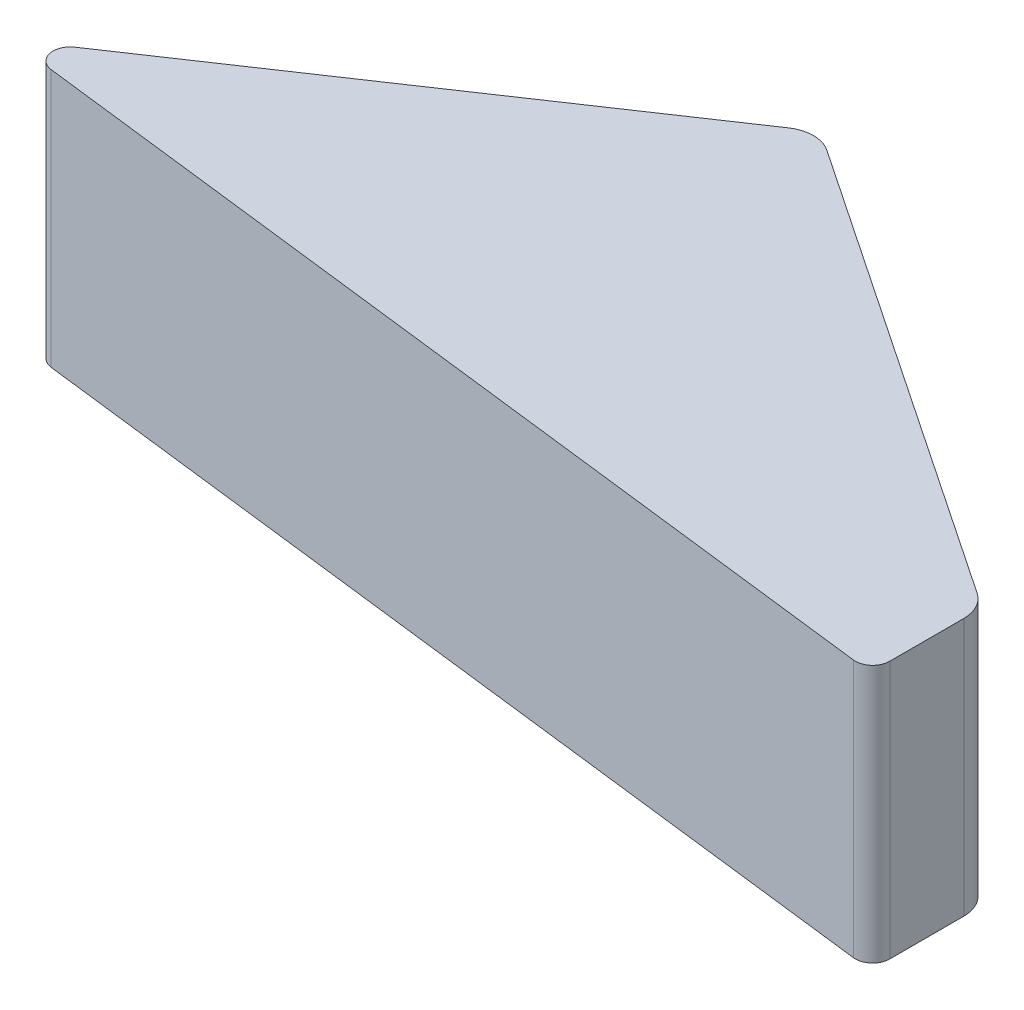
from build123d import *

# Parameters (mm, degrees)
EXTRUDE_1_DEPTH = 15


with BuildPart() as part:
    # Sketch 1 → Extrude 1 (new body)
    with BuildSketch(Plane(origin=(0, 0, 0), x_dir=(1, 0, 0), z_dir=(0, 1, 0))):
        with BuildLine():
            Line((27.884004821, 18.388075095), (3.068258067, 1.701624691))
            ThreePointArc((3.068258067, 1.701624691), (2.653958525, 0.638033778), (3.506435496, -0.121013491))
            Line((3.506435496, -0.121013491), (56.58017984, -6.526465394))
            ThreePointArc((56.58017984, -6.526465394), (57.363392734, -6.281941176), (57.7, -5.533669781))
            Line((57.7, -5.533669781), (57.7, -1.22505832))
            ThreePointArc((57.7, -1.22505832), (57.465218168, -0.284843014), (56.815995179, 0.434626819))
            Line((56.815995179, 0.434626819), (30.115995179, 18.388075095))
            ThreePointArc((30.115995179, 18.388075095), (29, 18.728389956), (27.884004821, 18.388075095))
        make_face()
    extrude(amount=EXTRUDE_1_DEPTH)


solid = part.part
